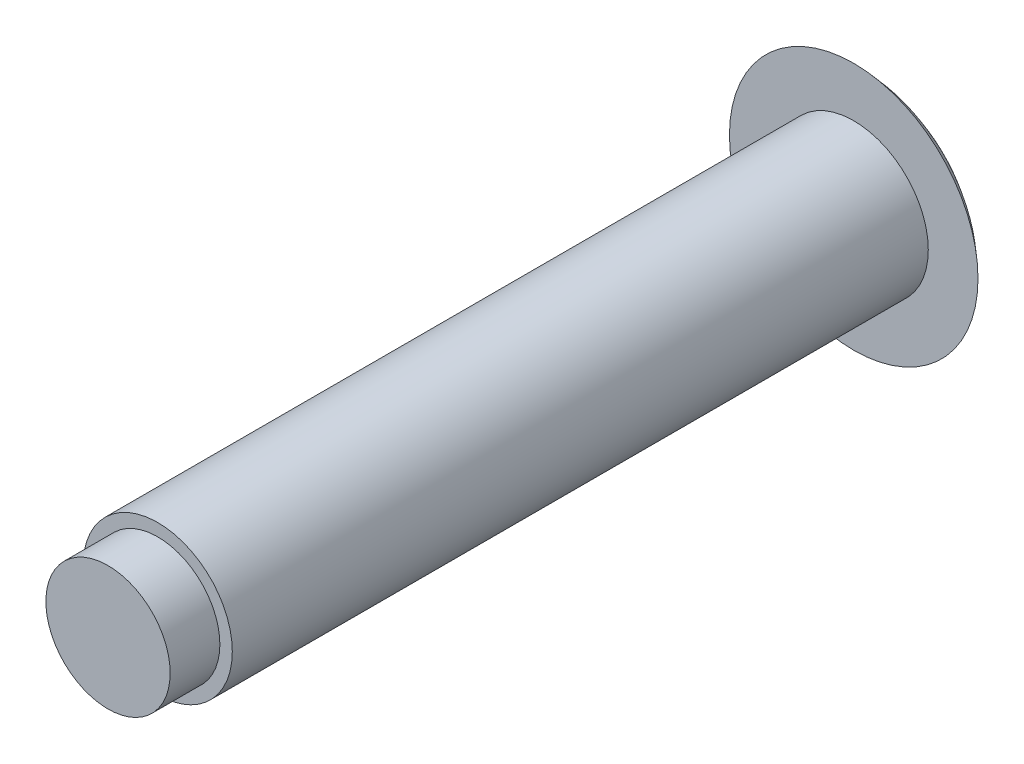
ISO-10303-21;
HEADER;
FILE_DESCRIPTION(('STEP AP214'),'2;1');
FILE_NAME('part.step','',(''),(''),'','','');
FILE_SCHEMA(('AUTOMOTIVE_DESIGN { 1 0 10303 214 1 1 1 1 }'));
ENDSEC;
DATA;
#1=APPLICATION_CONTEXT('core data for automotive mechanical design processes');
#2=APPLICATION_PROTOCOL_DEFINITION('international standard','automotive_design',2000,#1);
#3=PRODUCT_CONTEXT('',#1,'mechanical');
#4=PRODUCT('Part','Part','',(#3));
#5=PRODUCT_RELATED_PRODUCT_CATEGORY('part','',(#4));
#6=PRODUCT_DEFINITION_FORMATION('','',#4);
#7=PRODUCT_DEFINITION_CONTEXT('part definition',#1,'design');
#8=PRODUCT_DEFINITION('design','',#6,#7);
#9=PRODUCT_DEFINITION_SHAPE('','',#8);
#10=(LENGTH_UNIT() NAMED_UNIT(*) SI_UNIT(.MILLI.,.METRE.));
#11=(NAMED_UNIT(*) PLANE_ANGLE_UNIT() SI_UNIT($,.RADIAN.));
#12=(NAMED_UNIT(*) SI_UNIT($,.STERADIAN.) SOLID_ANGLE_UNIT());
#13=UNCERTAINTY_MEASURE_WITH_UNIT(LENGTH_MEASURE(1.E-05),#10,'distance_accuracy_value','');
#14=(GEOMETRIC_REPRESENTATION_CONTEXT(3) GLOBAL_UNCERTAINTY_ASSIGNED_CONTEXT((#13)) GLOBAL_UNIT_ASSIGNED_CONTEXT((#10,
#11,#12)) REPRESENTATION_CONTEXT('',''));
#15=CARTESIAN_POINT('',(0.,0.,0.));
#16=DIRECTION('',(0.,0.,1.));
#17=DIRECTION('',(1.,0.,0.));
#18=AXIS2_PLACEMENT_3D('',#15,#16,#17);
#19=CARTESIAN_POINT('',(0.,0.,28.));
#20=DIRECTION('',(0.,0.,1.));
#21=DIRECTION('',(1.,0.,0.));
#22=AXIS2_PLACEMENT_3D('',#19,#20,#21);
#23=PLANE('',#22);
#24=CARTESIAN_POINT('',(0.,0.,28.));
#25=DIRECTION('',(0.,0.,1.));
#26=DIRECTION('',(1.,0.,0.));
#27=AXIS2_PLACEMENT_3D('',#24,#25,#26);
#28=CIRCLE('',#27,3.);
#29=CARTESIAN_POINT('',(3.,0.,28.));
#30=VERTEX_POINT('',#29);
#31=EDGE_CURVE('E10',#30,#30,#28,.T.);
#32=ORIENTED_EDGE('',*,*,#31,.T.);
#33=EDGE_LOOP('',(#32));
#34=FACE_BOUND('',#33,.T.);
#35=CARTESIAN_POINT('',(0.,0.,28.));
#36=DIRECTION('',(0.,0.,1.));
#37=DIRECTION('',(1.,0.,0.));
#38=AXIS2_PLACEMENT_3D('',#35,#36,#37);
#39=CIRCLE('',#38,2.5);
#40=CARTESIAN_POINT('',(2.5,0.,28.));
#41=VERTEX_POINT('',#40);
#42=EDGE_CURVE('E48',#41,#41,#39,.T.);
#43=ORIENTED_EDGE('',*,*,#42,.F.);
#44=EDGE_LOOP('',(#43));
#45=FACE_BOUND('',#44,.T.);
#46=ADVANCED_FACE('F28',(#34,#45),#23,.T.);
#47=CARTESIAN_POINT('',(0.,0.,28.));
#48=DIRECTION('',(0.,0.,-1.));
#49=DIRECTION('',(-1.,0.,0.));
#50=AXIS2_PLACEMENT_3D('',#47,#48,#49);
#51=CYLINDRICAL_SURFACE('',#50,3.);
#52=ORIENTED_EDGE('',*,*,#31,.F.);
#53=EDGE_LOOP('',(#52));
#54=FACE_BOUND('',#53,.T.);
#55=CARTESIAN_POINT('',(0.,0.,0.));
#56=DIRECTION('',(0.,0.,1.));
#57=DIRECTION('',(1.,0.,0.));
#58=AXIS2_PLACEMENT_3D('',#55,#56,#57);
#59=CIRCLE('',#58,3.);
#60=CARTESIAN_POINT('',(3.,0.,0.));
#61=VERTEX_POINT('',#60);
#62=EDGE_CURVE('E35',#61,#61,#59,.T.);
#63=ORIENTED_EDGE('',*,*,#62,.T.);
#64=EDGE_LOOP('',(#63));
#65=FACE_BOUND('',#64,.T.);
#66=ADVANCED_FACE('F30',(#54,#65),#51,.T.);
#67=CARTESIAN_POINT('',(0.,0.,0.));
#68=DIRECTION('',(0.,0.,1.));
#69=DIRECTION('',(1.,0.,0.));
#70=AXIS2_PLACEMENT_3D('',#67,#68,#69);
#71=PLANE('',#70);
#72=CARTESIAN_POINT('',(0.,0.,0.));
#73=DIRECTION('',(0.,0.,1.));
#74=DIRECTION('',(1.,0.,0.));
#75=AXIS2_PLACEMENT_3D('',#72,#73,#74);
#76=CIRCLE('',#75,5.);
#77=CARTESIAN_POINT('',(5.,0.,0.));
#78=VERTEX_POINT('',#77);
#79=EDGE_CURVE('E39',#78,#78,#76,.T.);
#80=ORIENTED_EDGE('',*,*,#79,.T.);
#81=EDGE_LOOP('',(#80));
#82=FACE_BOUND('',#81,.T.);
#83=ORIENTED_EDGE('',*,*,#62,.F.);
#84=EDGE_LOOP('',(#83));
#85=FACE_BOUND('',#84,.T.);
#86=ADVANCED_FACE('F58',(#82,#85),#71,.T.);
#87=CARTESIAN_POINT('',(0.,0.,5.25));
#88=DIRECTION('',(0.,0.,1.));
#89=DIRECTION('',(1.,0.,0.));
#90=AXIS2_PLACEMENT_3D('',#87,#88,#89);
#91=SPHERICAL_SURFACE('',#90,7.25);
#92=ORIENTED_EDGE('',*,*,#79,.F.);
#93=EDGE_LOOP('',(#92));
#94=FACE_BOUND('',#93,.T.);
#95=ADVANCED_FACE('F61',(#94),#91,.T.);
#96=CARTESIAN_POINT('',(0.,0.,30.));
#97=DIRECTION('',(0.,0.,-1.));
#98=DIRECTION('',(-1.,0.,0.));
#99=AXIS2_PLACEMENT_3D('',#96,#97,#98);
#100=CYLINDRICAL_SURFACE('',#99,2.5);
#101=CARTESIAN_POINT('',(0.,0.,30.));
#102=DIRECTION('',(0.,0.,1.));
#103=DIRECTION('',(1.,0.,0.));
#104=AXIS2_PLACEMENT_3D('',#101,#102,#103);
#105=CIRCLE('',#104,2.5);
#106=CARTESIAN_POINT('',(2.5,0.,30.));
#107=VERTEX_POINT('',#106);
#108=EDGE_CURVE('E43',#107,#107,#105,.T.);
#109=ORIENTED_EDGE('',*,*,#108,.F.);
#110=EDGE_LOOP('',(#109));
#111=FACE_BOUND('',#110,.T.);
#112=ORIENTED_EDGE('',*,*,#42,.T.);
#113=EDGE_LOOP('',(#112));
#114=FACE_BOUND('',#113,.T.);
#115=ADVANCED_FACE('F52',(#111,#114),#100,.T.);
#116=CARTESIAN_POINT('',(0.,0.,30.));
#117=DIRECTION('',(0.,0.,1.));
#118=DIRECTION('',(1.,0.,0.));
#119=AXIS2_PLACEMENT_3D('',#116,#117,#118);
#120=PLANE('',#119);
#121=ORIENTED_EDGE('',*,*,#108,.T.);
#122=EDGE_LOOP('',(#121));
#123=FACE_BOUND('',#122,.T.);
#124=ADVANCED_FACE('F70',(#123),#120,.T.);
#125=CLOSED_SHELL('',(#46,#66,#86,#95,#115,#124));
#126=MANIFOLD_SOLID_BREP('B2',#125);
#127=ADVANCED_BREP_SHAPE_REPRESENTATION('',(#18,#126),#14);
#128=SHAPE_DEFINITION_REPRESENTATION(#9,#127);
ENDSEC;
END-ISO-10303-21;
